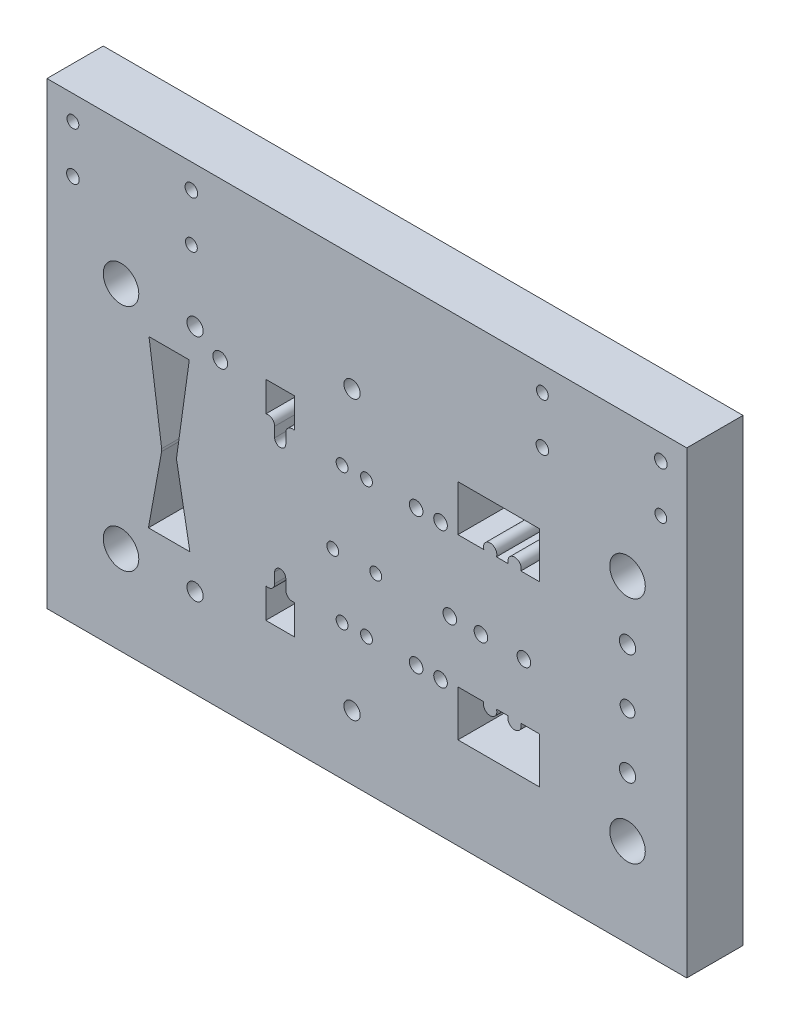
from build123d import *

# Parameters (mm, degrees)
ESQUISSE1_W             = 432
ESQUISSE1_H             = 310
BASE_EXTRUSION_DEPTH    = 38
ESQUISSE2_R             = 12
ENL_V_MAT_EXTRU_1_DEPTH = 534.074103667
ESQUISSE3_R             = 4.6
ESQUISSE3_R_2           = 4
ENL_V_MAT_EXTRU_2_DEPTH = 534.074103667
ESQUISSE4_R             = 4
ESQUISSE4_R_2           = 4.25
ENL_V_MAT_EXTRU_3_DEPTH = 534.074103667
ESQUISSE5_R             = 5.5
ENL_V_MAT_EXTRU_4_DEPTH = 534.074103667
ESQUISSE6_R             = 8.5
ENL_V_MAT_EXTRU_5_DEPTH = 11
ESQUISSE7_R             = 5
ENL_V_MAT_EXTRU_6_DEPTH = 534.074103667


with BuildPart() as part:
    # Esquisse1 → Base-Extrusion (new body)
    with BuildSketch(Plane.XY):
        with Locations((216, -155)):
            Rectangle(ESQUISSE1_W, ESQUISSE1_H)
    extrude(amount=BASE_EXTRUSION_DEPTH)

    # Esquisse2 → Enl_v. mat.-Extru.1 (cut, through all)
    with BuildSketch(Plane.XY.offset(38)):
        with Locations((50, -250)):
            Circle(ESQUISSE2_R)
        with Locations((50, -95)):
            Circle(ESQUISSE2_R)
        with Locations((392, -95)):
            Circle(ESQUISSE2_R)
        with Locations((392, -250)):
            Circle(ESQUISSE2_R)
    extrude(amount=-ENL_V_MAT_EXTRU_1_DEPTH, mode=Mode.SUBTRACT)

    # Esquisse3 → Enl_v. mat.-Extru.2 (cut, through all)
    with BuildSketch(Plane.XY.offset(38)):
        with Locations((322, -178.5)):
            Circle(ESQUISSE3_R)
        with Locations((293, -178.5)):
            Circle(ESQUISSE3_R)
        with Locations((265.75, -126.5)):
            Circle(ESQUISSE3_R)
        with Locations((249.25, -126.5)):
            Circle(ESQUISSE3_R)
        with Locations((265.75, -218.5)):
            Circle(ESQUISSE3_R)
        with Locations((249.25, -218.5)):
            Circle(ESQUISSE3_R)
        with Locations((215.75, -126.5)):
            Circle(ESQUISSE3_R_2)
        with Locations((199.25, -126.5)):
            Circle(ESQUISSE3_R_2)
        with Locations((222, -178.5)):
            Circle(ESQUISSE3_R_2)
        with Locations((193, -178.5)):
            Circle(ESQUISSE3_R_2)
        with Locations((215.75, -218.5)):
            Circle(ESQUISSE3_R_2)
        with Locations((199.25, -218.5)):
            Circle(ESQUISSE3_R_2)
        with Locations((272, -178.5)):
            Circle(ESQUISSE3_R)
        with BuildLine():
            Line((277.5, -128), (295.007359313, -128))
            ThreePointArc((295.007359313, -128), (299.25, -122), (303.492640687, -128))
            Line((303.492640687, -128), (311.507359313, -128))
            ThreePointArc((311.507359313, -128), (315.75, -122), (319.992640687, -128))
            Line((319.992640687, -128), (332.5, -128))
            Line((332.5, -128), (332.5, -97))
            Line((332.5, -97), (277.5, -97))
            Line((277.5, -97), (277.5, -128))
        make_face()
        with BuildLine():
            Line((277.5, -248), (332.5, -248))
            Line((332.5, -248), (332.5, -217))
            Line((332.5, -217), (319.992640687, -217))
            ThreePointArc((319.992640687, -217), (315.75, -223), (311.507359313, -217))
            Line((311.507359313, -217), (303.492640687, -217))
            ThreePointArc((303.492640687, -217), (299.25, -223), (295.007359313, -217))
            Line((295.007359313, -217), (277.5, -217))
            Line((277.5, -217), (277.5, -248))
        make_face()
        with BuildLine():
            Line((161.25, -133.25), (161.25, -126.5))
            ThreePointArc((161.25, -126.5), (163.151923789, -122.825765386), (167.25, -122.257359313))
            Line((167.25, -122.257359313), (167.25, -102))
            Line((167.25, -102), (147.75, -102))
            Line((147.75, -102), (147.75, -122.257359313))
            ThreePointArc((147.75, -122.257359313), (151.848076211, -122.825765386), (153.75, -126.5))
            Line((153.75, -126.5), (153.75, -133.25))
            ThreePointArc((153.75, -133.25), (157.5, -137), (161.25, -133.25))
        make_face()
        with BuildLine():
            Line((147.75, -243), (167.25, -243))
            Line((167.25, -243), (167.25, -222.742640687))
            ThreePointArc((167.25, -222.742640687), (163.151923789, -222.174234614), (161.25, -218.5))
            Line((161.25, -218.5), (161.25, -211.75))
            ThreePointArc((161.25, -211.75), (157.5, -208), (153.75, -211.75))
            Line((153.75, -211.75), (153.75, -218.5))
            ThreePointArc((153.75, -218.5), (151.848076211, -222.174234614), (147.75, -222.742640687))
            Line((147.75, -222.742640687), (147.75, -243))
        make_face()
        with BuildLine():
            Line((68.897546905, -116.5), (77.447171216, -177.73952269))
            ThreePointArc((77.447171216, -177.73952269), (77.498845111, -178.612705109), (77.411435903, -179.48303686))
            Line((77.411435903, -179.48303686), (68.507055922, -228.5))
            Line((68.507055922, -228.5), (96.492944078, -228.5))
            Line((96.492944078, -228.5), (87.588564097, -179.48303686))
            ThreePointArc((87.588564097, -179.48303686), (87.501154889, -178.612705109), (87.552828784, -177.73952269))
            Line((87.552828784, -177.73952269), (96.102453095, -116.5))
            Line((96.102453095, -116.5), (68.897546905, -116.5))
        make_face()
    extrude(amount=-ENL_V_MAT_EXTRU_2_DEPTH, mode=Mode.SUBTRACT)

    # Esquisse4 → Enl_v. mat.-Extru.3 (cut, through all)
    with BuildSketch(Plane(origin=(0, 0, 0), x_dir=(-1, 0, 0), z_dir=(0, 0, -1))):
        with Locations((-334.5, -16.5)):
            Circle(ESQUISSE4_R)
        with Locations((-414.5, -48.5)):
            Circle(ESQUISSE4_R)
        with Locations((-334.5, -48.5)):
            Circle(ESQUISSE4_R_2)
        with Locations((-414.5, -16.5)):
            Circle(ESQUISSE4_R_2)
        with Locations((-17.5, -16.5)):
            Circle(ESQUISSE4_R)
        with Locations((-97.5, -48.5)):
            Circle(ESQUISSE4_R)
        with Locations((-17.5, -48.5)):
            Circle(ESQUISSE4_R_2)
        with Locations((-97.5, -16.5)):
            Circle(ESQUISSE4_R_2)
    extrude(amount=-ENL_V_MAT_EXTRU_3_DEPTH, mode=Mode.SUBTRACT)

    # Esquisse5 → Enl_v. mat.-Extru.4 (cut, through all)
    with BuildSketch(Plane(origin=(0, 0, 0), x_dir=(-1, 0, 0), z_dir=(0, 0, -1))):
        with Locations((-392, -135)):
            Circle(ESQUISSE5_R)
        with Locations((-392, -210)):
            Circle(ESQUISSE5_R)
        with Locations((-206, -78.5)):
            Circle(ESQUISSE5_R)
        with Locations((-100, -95)):
            Circle(ESQUISSE5_R)
        with Locations((-100, -250)):
            Circle(ESQUISSE5_R)
        with Locations((-206, -266.5)):
            Circle(ESQUISSE5_R)
    extrude(amount=-ENL_V_MAT_EXTRU_4_DEPTH, mode=Mode.SUBTRACT)

    # Esquisse6 → Enl_v. mat.-Extru.5 (cut)
    with BuildSketch(Plane(origin=(0, 0, 0), x_dir=(-1, 0, 0), z_dir=(0, 0, -1))):
        with Locations((-100, -95)):
            Circle(ESQUISSE6_R)
        with Locations((-100, -250)):
            Circle(ESQUISSE6_R)
        with Locations((-206, -78.5)):
            Circle(ESQUISSE6_R)
        with Locations((-206, -266.5)):
            Circle(ESQUISSE6_R)
        with Locations((-392, -135)):
            Circle(ESQUISSE6_R)
        with Locations((-392, -210)):
            Circle(ESQUISSE6_R)
    extrude(amount=-ENL_V_MAT_EXTRU_5_DEPTH, mode=Mode.SUBTRACT)

    # Esquisse7 → Enl_v. mat.-Extru.6 (cut, through all)
    with BuildSketch(Plane(origin=(0, 0, 0), x_dir=(-1, 0, 0), z_dir=(0, 0, -1))):
        with Locations((-392, -172.5)):
            Circle(ESQUISSE7_R)
        with Locations((-117, -106)):
            Circle(ESQUISSE7_R)
    extrude(amount=-ENL_V_MAT_EXTRU_6_DEPTH, mode=Mode.SUBTRACT)


solid = part.part
